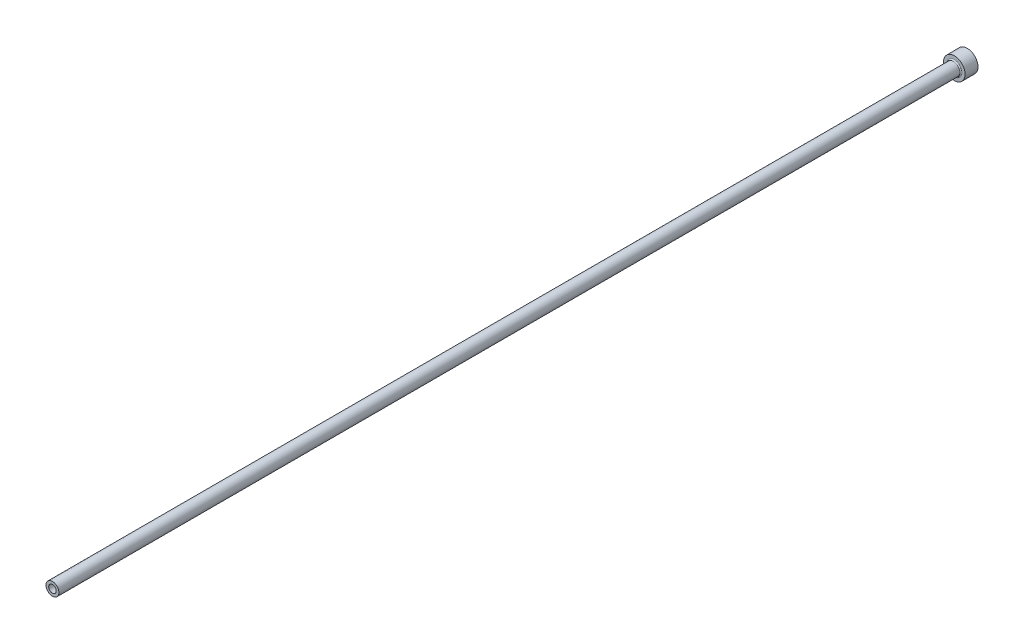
ISO-10303-21;
HEADER;
FILE_DESCRIPTION(('STEP AP214'),'2;1');
FILE_NAME('part.step','',(''),(''),'','','');
FILE_SCHEMA(('AUTOMOTIVE_DESIGN { 1 0 10303 214 1 1 1 1 }'));
ENDSEC;
DATA;
#1=APPLICATION_CONTEXT('core data for automotive mechanical design processes');
#2=APPLICATION_PROTOCOL_DEFINITION('international standard','automotive_design',2000,#1);
#3=PRODUCT_CONTEXT('',#1,'mechanical');
#4=PRODUCT('Part','Part','',(#3));
#5=PRODUCT_RELATED_PRODUCT_CATEGORY('part','',(#4));
#6=PRODUCT_DEFINITION_FORMATION('','',#4);
#7=PRODUCT_DEFINITION_CONTEXT('part definition',#1,'design');
#8=PRODUCT_DEFINITION('design','',#6,#7);
#9=PRODUCT_DEFINITION_SHAPE('','',#8);
#10=(LENGTH_UNIT() NAMED_UNIT(*) SI_UNIT(.MILLI.,.METRE.));
#11=(NAMED_UNIT(*) PLANE_ANGLE_UNIT() SI_UNIT($,.RADIAN.));
#12=(NAMED_UNIT(*) SI_UNIT($,.STERADIAN.) SOLID_ANGLE_UNIT());
#13=UNCERTAINTY_MEASURE_WITH_UNIT(LENGTH_MEASURE(1.E-05),#10,'distance_accuracy_value','');
#14=(GEOMETRIC_REPRESENTATION_CONTEXT(3) GLOBAL_UNCERTAINTY_ASSIGNED_CONTEXT((#13)) GLOBAL_UNIT_ASSIGNED_CONTEXT((#10,
#11,#12)) REPRESENTATION_CONTEXT('',''));
#15=CARTESIAN_POINT('',(0.,0.,0.));
#16=DIRECTION('',(0.,0.,1.));
#17=DIRECTION('',(1.,0.,0.));
#18=AXIS2_PLACEMENT_3D('',#15,#16,#17);
#19=CARTESIAN_POINT('',(0.,0.,425.));
#20=DIRECTION('',(0.,0.,-1.));
#21=DIRECTION('',(-1.,0.,0.));
#22=AXIS2_PLACEMENT_3D('',#19,#20,#21);
#23=PLANE('',#22);
#24=CARTESIAN_POINT('',(0.,0.,425.));
#25=DIRECTION('',(0.,0.,1.));
#26=DIRECTION('',(1.,0.,0.));
#27=AXIS2_PLACEMENT_3D('',#24,#25,#26);
#28=CIRCLE('',#27,1.74999999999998);
#29=CARTESIAN_POINT('',(1.74999999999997,0.,425.));
#30=VERTEX_POINT('',#29);
#31=EDGE_CURVE('E63',#30,#30,#28,.T.);
#32=ORIENTED_EDGE('',*,*,#31,.F.);
#33=EDGE_LOOP('',(#32));
#34=FACE_BOUND('',#33,.T.);
#35=CARTESIAN_POINT('',(0.,0.,425.));
#36=DIRECTION('',(0.,0.,1.));
#37=DIRECTION('',(1.,0.,0.));
#38=AXIS2_PLACEMENT_3D('',#35,#36,#37);
#39=CIRCLE('',#38,2.99999999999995);
#40=CARTESIAN_POINT('',(2.99999999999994,0.,425.));
#41=VERTEX_POINT('',#40);
#42=EDGE_CURVE('E54',#41,#41,#39,.T.);
#43=ORIENTED_EDGE('',*,*,#42,.T.);
#44=EDGE_LOOP('',(#43));
#45=FACE_BOUND('',#44,.T.);
#46=ADVANCED_FACE('F34',(#34,#45),#23,.F.);
#47=CARTESIAN_POINT('',(0.,0.,425.));
#48=DIRECTION('',(0.,0.,1.));
#49=DIRECTION('',(1.,0.,0.));
#50=AXIS2_PLACEMENT_3D('',#47,#48,#49);
#51=CYLINDRICAL_SURFACE('',#50,2.99999999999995);
#52=CARTESIAN_POINT('',(0.,0.,6.50000000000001));
#53=DIRECTION('',(0.,0.,1.));
#54=DIRECTION('',(1.,0.,0.));
#55=AXIS2_PLACEMENT_3D('',#52,#53,#54);
#56=CIRCLE('',#55,2.99999999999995);
#57=CARTESIAN_POINT('',(2.99999999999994,0.,6.50000000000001));
#58=VERTEX_POINT('',#57);
#59=EDGE_CURVE('E49',#58,#58,#56,.T.);
#60=ORIENTED_EDGE('',*,*,#59,.T.);
#61=EDGE_LOOP('',(#60));
#62=FACE_BOUND('',#61,.T.);
#63=ORIENTED_EDGE('',*,*,#42,.F.);
#64=EDGE_LOOP('',(#63));
#65=FACE_BOUND('',#64,.T.);
#66=ADVANCED_FACE('F92',(#62,#65),#51,.T.);
#67=CARTESIAN_POINT('',(0.,0.,6.));
#68=DIRECTION('',(0.,0.,1.));
#69=DIRECTION('',(1.,0.,0.));
#70=AXIS2_PLACEMENT_3D('',#67,#68,#69);
#71=PLANE('',#70);
#72=CARTESIAN_POINT('',(0.,0.,6.));
#73=DIRECTION('',(0.,0.,1.));
#74=DIRECTION('',(1.,0.,0.));
#75=AXIS2_PLACEMENT_3D('',#72,#73,#74);
#76=CIRCLE('',#75,3.49999999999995);
#77=CARTESIAN_POINT('',(3.49999999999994,0.,6.));
#78=VERTEX_POINT('',#77);
#79=EDGE_CURVE('E45',#78,#78,#76,.F.);
#80=ORIENTED_EDGE('',*,*,#79,.T.);
#81=EDGE_LOOP('',(#80));
#82=FACE_BOUND('',#81,.T.);
#83=CARTESIAN_POINT('',(0.,0.,6.00000000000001));
#84=DIRECTION('',(0.,0.,1.));
#85=DIRECTION('',(1.,0.,0.));
#86=AXIS2_PLACEMENT_3D('',#83,#84,#85);
#87=CIRCLE('',#86,4.99999999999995);
#88=CARTESIAN_POINT('',(4.99999999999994,0.,6.00000000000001));
#89=VERTEX_POINT('',#88);
#90=EDGE_CURVE('E57',#89,#89,#87,.T.);
#91=ORIENTED_EDGE('',*,*,#90,.T.);
#92=EDGE_LOOP('',(#91));
#93=FACE_BOUND('',#92,.T.);
#94=ADVANCED_FACE('F98',(#82,#93),#71,.T.);
#95=CARTESIAN_POINT('',(0.,0.,425.));
#96=DIRECTION('',(0.,0.,1.));
#97=DIRECTION('',(1.,0.,0.));
#98=AXIS2_PLACEMENT_3D('',#95,#96,#97);
#99=CYLINDRICAL_SURFACE('',#98,4.99999999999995);
#100=ORIENTED_EDGE('',*,*,#90,.F.);
#101=EDGE_LOOP('',(#100));
#102=FACE_BOUND('',#101,.T.);
#103=CARTESIAN_POINT('',(0.,0.,0.));
#104=DIRECTION('',(0.,0.,1.));
#105=DIRECTION('',(1.,0.,0.));
#106=AXIS2_PLACEMENT_3D('',#103,#104,#105);
#107=CIRCLE('',#106,4.99999999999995);
#108=CARTESIAN_POINT('',(4.99999999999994,0.,0.));
#109=VERTEX_POINT('',#108);
#110=EDGE_CURVE('E60',#109,#109,#107,.T.);
#111=ORIENTED_EDGE('',*,*,#110,.T.);
#112=EDGE_LOOP('',(#111));
#113=FACE_BOUND('',#112,.T.);
#114=ADVANCED_FACE('F89',(#102,#113),#99,.T.);
#115=CARTESIAN_POINT('',(0.,0.,0.));
#116=DIRECTION('',(0.,0.,1.));
#117=DIRECTION('',(1.,0.,0.));
#118=AXIS2_PLACEMENT_3D('',#115,#116,#117);
#119=PLANE('',#118);
#120=CARTESIAN_POINT('',(0.,0.,0.));
#121=DIRECTION('',(0.,0.,1.));
#122=DIRECTION('',(1.,0.,0.));
#123=AXIS2_PLACEMENT_3D('',#120,#121,#122);
#124=CIRCLE('',#123,2.5);
#125=CARTESIAN_POINT('',(2.49999999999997,0.,0.));
#126=VERTEX_POINT('',#125);
#127=EDGE_CURVE('E41',#126,#126,#124,.T.);
#128=ORIENTED_EDGE('',*,*,#127,.T.);
#129=EDGE_LOOP('',(#128));
#130=FACE_BOUND('',#129,.T.);
#131=ORIENTED_EDGE('',*,*,#110,.F.);
#132=EDGE_LOOP('',(#131));
#133=FACE_BOUND('',#132,.T.);
#134=ADVANCED_FACE('F83',(#130,#133),#119,.F.);
#135=CARTESIAN_POINT('',(0.,0.,425.));
#136=DIRECTION('',(0.,0.,1.));
#137=DIRECTION('',(1.,0.,0.));
#138=AXIS2_PLACEMENT_3D('',#135,#136,#137);
#139=CYLINDRICAL_SURFACE('',#138,1.75000000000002);
#140=ORIENTED_EDGE('',*,*,#31,.T.);
#141=EDGE_LOOP('',(#140));
#142=FACE_BOUND('',#141,.T.);
#143=CARTESIAN_POINT('',(0.,0.,275.));
#144=DIRECTION('',(0.,0.,1.));
#145=DIRECTION('',(1.,0.,0.));
#146=AXIS2_PLACEMENT_3D('',#143,#144,#145);
#147=CIRCLE('',#146,1.75000000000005);
#148=CARTESIAN_POINT('',(1.75000000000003,0.,275.));
#149=VERTEX_POINT('',#148);
#150=EDGE_CURVE('E66',#149,#149,#147,.T.);
#151=ORIENTED_EDGE('',*,*,#150,.F.);
#152=EDGE_LOOP('',(#151));
#153=FACE_BOUND('',#152,.T.);
#154=ADVANCED_FACE('F78',(#142,#153),#139,.F.);
#155=CARTESIAN_POINT('',(0.,0.,275.));
#156=DIRECTION('',(0.,0.,-1.));
#157=DIRECTION('',(-1.,0.,0.));
#158=AXIS2_PLACEMENT_3D('',#155,#156,#157);
#159=CONICAL_SURFACE('',#158,1.75000000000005,0.523598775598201);
#160=CARTESIAN_POINT('',(0.,0.,274.566987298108));
#161=DIRECTION('',(0.,0.,1.));
#162=DIRECTION('',(1.,0.,0.));
#163=AXIS2_PLACEMENT_3D('',#160,#161,#162);
#164=CIRCLE('',#163,1.99999999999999);
#165=CARTESIAN_POINT('',(1.99999999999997,0.,274.566987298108));
#166=VERTEX_POINT('',#165);
#167=EDGE_CURVE('E69',#166,#166,#164,.T.);
#168=ORIENTED_EDGE('',*,*,#167,.F.);
#169=EDGE_LOOP('',(#168));
#170=FACE_BOUND('',#169,.T.);
#171=ORIENTED_EDGE('',*,*,#150,.T.);
#172=EDGE_LOOP('',(#171));
#173=FACE_BOUND('',#172,.T.);
#174=ADVANCED_FACE('F75',(#170,#173),#159,.F.);
#175=CARTESIAN_POINT('',(0.,0.,425.));
#176=DIRECTION('',(0.,0.,1.));
#177=DIRECTION('',(1.,0.,0.));
#178=AXIS2_PLACEMENT_3D('',#175,#176,#177);
#179=CYLINDRICAL_SURFACE('',#178,1.99999999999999);
#180=CARTESIAN_POINT('',(0.,0.,0.500000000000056));
#181=DIRECTION('',(0.,0.,1.));
#182=DIRECTION('',(1.,0.,0.));
#183=AXIS2_PLACEMENT_3D('',#180,#181,#182);
#184=CIRCLE('',#183,1.99999999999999);
#185=CARTESIAN_POINT('',(1.99999999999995,0.,0.500000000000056));
#186=VERTEX_POINT('',#185);
#187=EDGE_CURVE('E10',#186,#186,#184,.F.);
#188=ORIENTED_EDGE('',*,*,#187,.T.);
#189=EDGE_LOOP('',(#188));
#190=FACE_BOUND('',#189,.T.);
#191=ORIENTED_EDGE('',*,*,#167,.T.);
#192=EDGE_LOOP('',(#191));
#193=FACE_BOUND('',#192,.T.);
#194=ADVANCED_FACE('F73',(#190,#193),#179,.F.);
#195=CARTESIAN_POINT('',(0.,0.,6.50000000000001));
#196=DIRECTION('',(0.,0.,1.));
#197=DIRECTION('',(1.,0.,0.));
#198=AXIS2_PLACEMENT_3D('',#195,#196,#197);
#199=TOROIDAL_SURFACE('',#198,3.49999999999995,0.5);
#200=ORIENTED_EDGE('',*,*,#79,.F.);
#201=EDGE_LOOP('',(#200));
#202=FACE_BOUND('',#201,.T.);
#203=ORIENTED_EDGE('',*,*,#59,.F.);
#204=EDGE_LOOP('',(#203));
#205=FACE_BOUND('',#204,.T.);
#206=ADVANCED_FACE('F104',(#202,#205),#199,.F.);
#207=CARTESIAN_POINT('',(0.,0.,0.));
#208=DIRECTION('',(0.,0.,-1.));
#209=DIRECTION('',(-1.,0.,0.));
#210=AXIS2_PLACEMENT_3D('',#207,#208,#209);
#211=CONICAL_SURFACE('',#210,2.5,0.785398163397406);
#212=ORIENTED_EDGE('',*,*,#187,.F.);
#213=EDGE_LOOP('',(#212));
#214=FACE_BOUND('',#213,.T.);
#215=ORIENTED_EDGE('',*,*,#127,.F.);
#216=EDGE_LOOP('',(#215));
#217=FACE_BOUND('',#216,.T.);
#218=ADVANCED_FACE('F36',(#214,#217),#211,.F.);
#219=CLOSED_SHELL('',(#46,#66,#94,#114,#134,#154,#174,#194,#206,#218));
#220=MANIFOLD_SOLID_BREP('B2',#219);
#221=ADVANCED_BREP_SHAPE_REPRESENTATION('',(#18,#220),#14);
#222=SHAPE_DEFINITION_REPRESENTATION(#9,#221);
ENDSEC;
END-ISO-10303-21;
